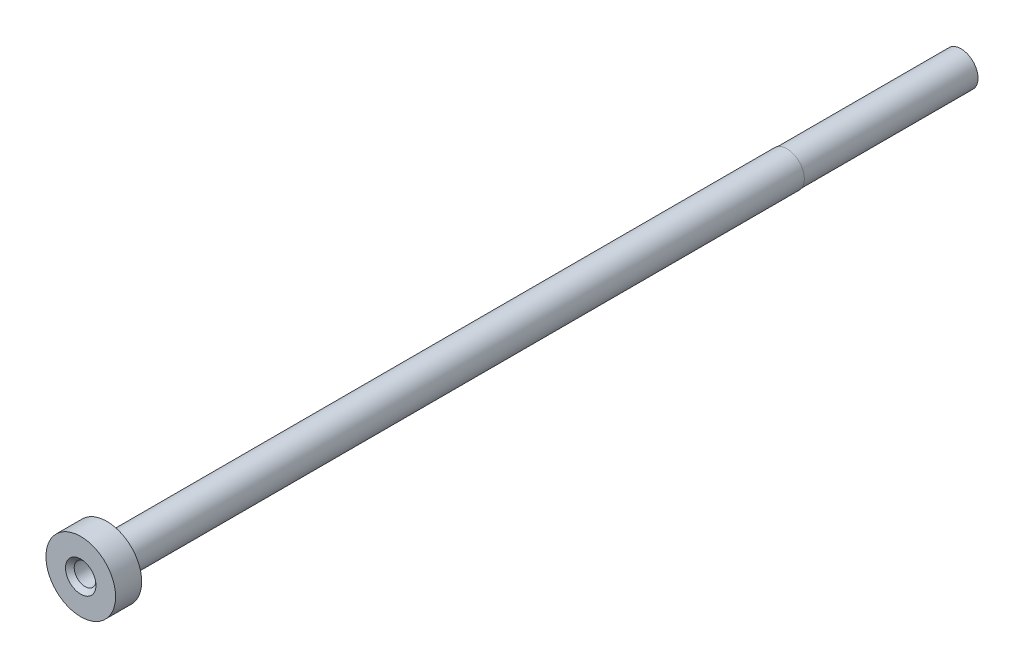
from build123d import *

# Parameters (mm, degrees)
ESQUISSE1_R              = 4
T_TE_DEPTH               = 3
ESQUISSE2_R              = 2
LONGUEUR_TOTALE_DEPTH    = 122
ESQUISSE3_R              = 1.25
PASSAGE_DEPTH            = 90
GUIDAGE_REACH            = 127.128
ESQUISSE4_R              = 1.1
CONG_1_R                 = 0.3
CHANFREIN1_SIZE          = 0.5
ESQUISSE5_R              = 2
ESQUISSE5_R_2            = 1.1
MISE_LONGUEUR_DEPTH      = 23.87575
AJUSTEMENT_START         = -20
ESQUISSE6_R              = 2
ESQUISSE6_R_2            = 1.952561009
AJUSTEMENT_AU_DIAM_DEPTH = 20


with BuildPart() as part:
    # Esquisse1 → T_te (new body)
    with BuildSketch(Plane.XY):
        Circle(ESQUISSE1_R)
    extrude(amount=-T_TE_DEPTH)

    # Esquisse2 → Longueur totale (add)
    with BuildSketch(Plane(origin=(0, 0, -3), x_dir=(-1, 0, 0), z_dir=(0, 0, -1))):
        with Locations(Location((0, 0, 0), (0, 0, 180))):
            Circle(ESQUISSE2_R)
    extrude(amount=LONGUEUR_TOTALE_DEPTH)

    # Esquisse3 → Passage (cut)
    with BuildSketch(Plane.XY):
        Circle(ESQUISSE3_R)
    extrude(amount=-PASSAGE_DEPTH, mode=Mode.SUBTRACT)

    # Esquisse4 → Guidage (cut, up to next)
    with BuildSketch(Plane(origin=(0, 0, -125), x_dir=(-1, 0, 0), z_dir=(0, 0, -1)), mode=Mode.PRIVATE) as guidage_sk1:
        with Locations(Location((0, 0, 0), (0, 0, 180))):
            Circle(ESQUISSE4_R)
    guidage_tool1 = extrude(guidage_sk1.sketch, amount=-GUIDAGE_REACH, mode=Mode.PRIVATE) & part.part
    add(guidage_tool1.solids().sort_by_distance((0, 0, -125))[0], mode=Mode.SUBTRACT)

    # Cong_1
    cong_1_edges = [part.edges().sort_by_distance(p)[0] for p in [
        (-2, 0, -3),
    ]]
    fillet(cong_1_edges, radius=CONG_1_R)

    # Chanfrein1
    chanfrein1_edges = [part.edges().sort_by_distance(p)[0] for p in [
        (-1.25, 0, 0),
    ]]
    chamfer(chanfrein1_edges, length=CHANFREIN1_SIZE)

    # Esquisse5 → Mise _ Longueur (cut)
    with BuildSketch(Plane(origin=(0, 0, -125), x_dir=(-1, 0, 0), z_dir=(0, 0, -1))):
        with Locations(Location((0, 0, 0), (0, 0, 180))):
            Circle(ESQUISSE5_R)
        with Locations(Location((0, 0, 0), (0, 0, 180))):
            Circle(ESQUISSE5_R_2, mode=Mode.SUBTRACT)
    extrude(amount=-MISE_LONGUEUR_DEPTH, mode=Mode.SUBTRACT)

    # Esquisse6 → Ajustement au diam (cut)
    with BuildSketch(Plane(origin=(0, 0, -101.12425), x_dir=(-1, 0, 0), z_dir=(0, 0, -1)).offset(AJUSTEMENT_START)):
        with Locations(Location((0, 0, 0), (0, 0, 180))):
            Circle(ESQUISSE6_R)
        Circle(ESQUISSE6_R_2, mode=Mode.SUBTRACT)
    extrude(amount=AJUSTEMENT_AU_DIAM_DEPTH, mode=Mode.SUBTRACT)


solid = part.part
